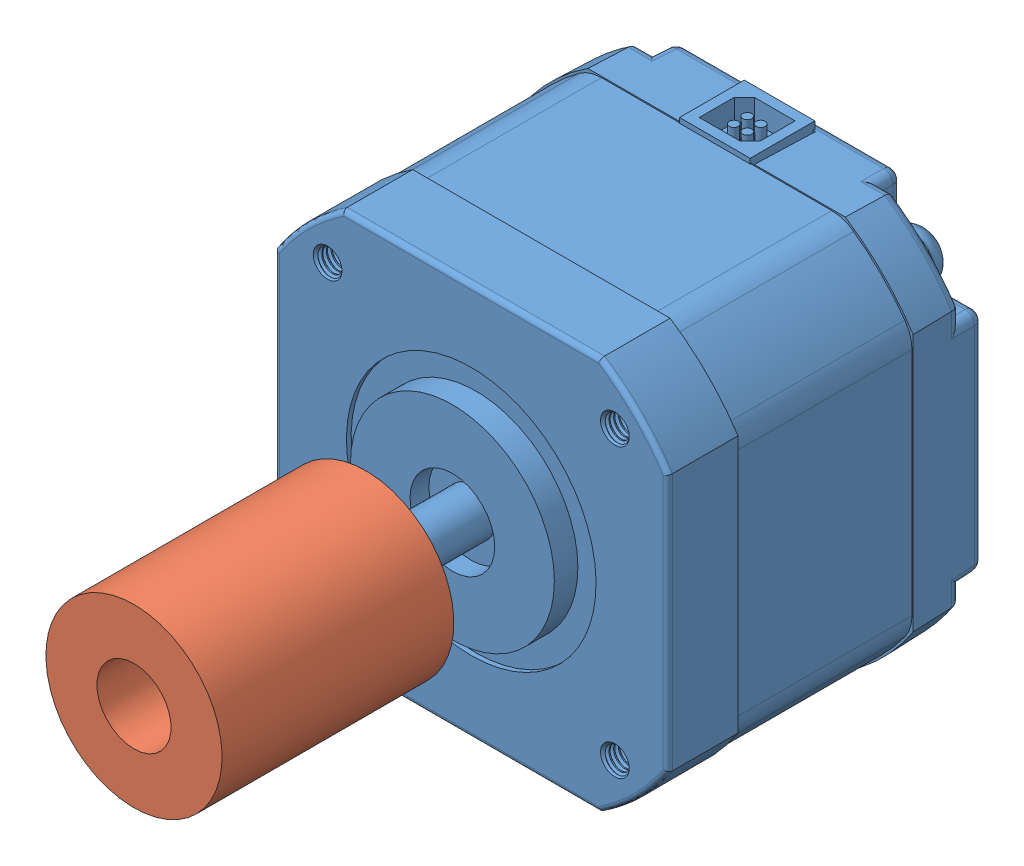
SolidWorks assembly Y Axis Drive_.sldasm, configuration Default (file format 8000). Lengths in mm.
Overall size (42.42 42.97 439.17).
3 component instances, 3 part files, 4 mates.
Components (placement in the parent):
- 6627T660_POSITION-CONTROL DC MOTOR-1: 6627T660_POSITION-CONTROL DC MOTOR.SLDPRT [6627T66] at origin size (42.42 42.97 58.17)
- 5mm to 8mm coupler-1: 5mm to 8mm coupler.SLDPRT [Default] at (0 0 11.376) x (-0.66146 0.74998 0) z (0.74998 0.66146 0) size (19 25 19)
- 8mm Rod Y Axis-1: 8mm Rod Y Axis.SLDPRT [Default] at (0 0 23.876) x (0.162098 0.986775 0) z (0.986775 -0.162098 0) size (8 381 8)
Mates (geometry in assembly coordinates):
- Concentric16: concentric anti-aligned: cylinder of 6627T660_POSITION-CONTROL DC MOTOR-1 through (0 0 23.876) axis (0 0 1) radius 2.4956; cylinder of 5mm to 8mm coupler-1 through (0 0 36.376) axis (0 0 -1) radius 2.5
- Coincident291: coincident aligned: plane of 6627T660_POSITION-CONTROL DC MOTOR-1 through (0 2.4956 23.876) normal (0 0 1); circle of 5mm to 8mm coupler-1
- Concentric20: concentric anti-aligned: cylinder of 5mm to 8mm coupler-1 through (0 0 23.876) axis (0 0 1) radius 4; cylinder of 8mm Rod Y Axis-1 through (0 0 404.876) axis (0 0 -1) radius 4
- Coincident296: coincident anti-aligned: plane of 5mm to 8mm coupler-1 through (0 0 23.876) normal (0 0 1); plane of 8mm Rod Y Axis-1 through (0 0 23.876) normal (0 0 -1)
